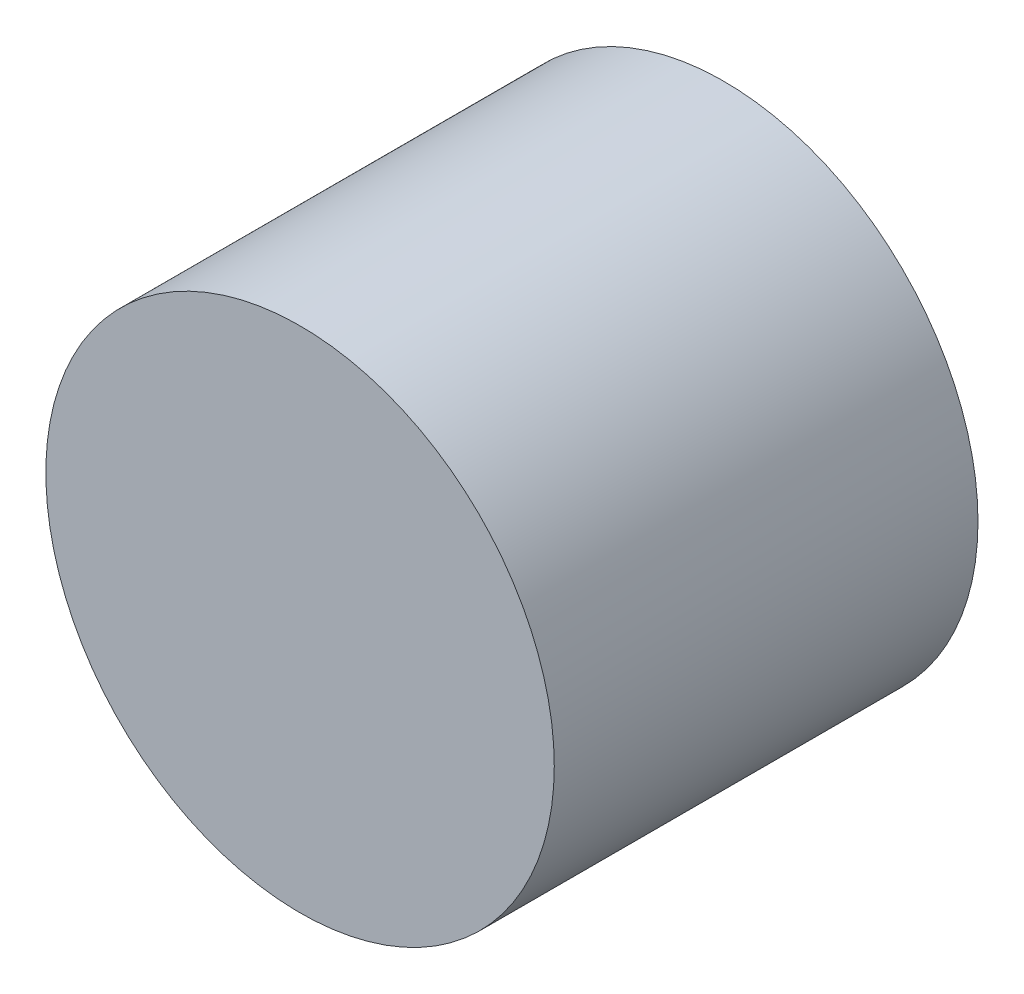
ISO-10303-21;
HEADER;
FILE_DESCRIPTION(('STEP AP214'),'2;1');
FILE_NAME('part.step','',(''),(''),'','','');
FILE_SCHEMA(('AUTOMOTIVE_DESIGN { 1 0 10303 214 1 1 1 1 }'));
ENDSEC;
DATA;
#1=APPLICATION_CONTEXT('core data for automotive mechanical design processes');
#2=APPLICATION_PROTOCOL_DEFINITION('international standard','automotive_design',2000,#1);
#3=PRODUCT_CONTEXT('',#1,'mechanical');
#4=PRODUCT('Part','Part','',(#3));
#5=PRODUCT_RELATED_PRODUCT_CATEGORY('part','',(#4));
#6=PRODUCT_DEFINITION_FORMATION('','',#4);
#7=PRODUCT_DEFINITION_CONTEXT('part definition',#1,'design');
#8=PRODUCT_DEFINITION('design','',#6,#7);
#9=PRODUCT_DEFINITION_SHAPE('','',#8);
#10=(LENGTH_UNIT() NAMED_UNIT(*) SI_UNIT(.MILLI.,.METRE.));
#11=(NAMED_UNIT(*) PLANE_ANGLE_UNIT() SI_UNIT($,.RADIAN.));
#12=(NAMED_UNIT(*) SI_UNIT($,.STERADIAN.) SOLID_ANGLE_UNIT());
#13=UNCERTAINTY_MEASURE_WITH_UNIT(LENGTH_MEASURE(1.E-05),#10,'distance_accuracy_value','');
#14=(GEOMETRIC_REPRESENTATION_CONTEXT(3) GLOBAL_UNCERTAINTY_ASSIGNED_CONTEXT((#13)) GLOBAL_UNIT_ASSIGNED_CONTEXT((#10,
#11,#12)) REPRESENTATION_CONTEXT('',''));
#15=CARTESIAN_POINT('',(0.,0.,0.));
#16=DIRECTION('',(0.,0.,1.));
#17=DIRECTION('',(1.,0.,0.));
#18=AXIS2_PLACEMENT_3D('',#15,#16,#17);
#19=CARTESIAN_POINT('',(0.,0.,9.));
#20=DIRECTION('',(0.,0.,1.));
#21=DIRECTION('',(1.,0.,0.));
#22=AXIS2_PLACEMENT_3D('',#19,#20,#21);
#23=CYLINDRICAL_SURFACE('',#22,3.);
#24=CARTESIAN_POINT('',(0.,0.,0.));
#25=DIRECTION('',(0.,0.,1.));
#26=DIRECTION('',(1.,0.,0.));
#27=AXIS2_PLACEMENT_3D('',#24,#25,#26);
#28=CIRCLE('',#27,3.);
#29=CARTESIAN_POINT('',(3.,0.,0.));
#30=VERTEX_POINT('',#29);
#31=EDGE_CURVE('E69',#30,#30,#28,.T.);
#32=ORIENTED_EDGE('',*,*,#31,.F.);
#33=EDGE_LOOP('',(#32));
#34=FACE_BOUND('',#33,.T.);
#35=CARTESIAN_POINT('',(0.,0.,4.49784845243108));
#36=DIRECTION('',(0.,0.,1.));
#37=DIRECTION('',(1.,0.,0.));
#38=AXIS2_PLACEMENT_3D('',#35,#36,#37);
#39=CIRCLE('',#38,3.);
#40=CARTESIAN_POINT('',(3.,0.,4.49784845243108));
#41=VERTEX_POINT('',#40);
#42=EDGE_CURVE('E11',#41,#41,#39,.T.);
#43=ORIENTED_EDGE('',*,*,#42,.T.);
#44=EDGE_LOOP('',(#43));
#45=FACE_BOUND('',#44,.T.);
#46=ADVANCED_FACE('F34',(#34,#45),#23,.F.);
#47=CARTESIAN_POINT('',(0.,2.5,4.49784845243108));
#48=DIRECTION('',(0.,0.,1.));
#49=DIRECTION('',(1.,0.,0.));
#50=AXIS2_PLACEMENT_3D('',#47,#48,#49);
#51=PLANE('',#50);
#52=ORIENTED_EDGE('',*,*,#42,.F.);
#53=EDGE_LOOP('',(#52));
#54=FACE_BOUND('',#53,.T.);
#55=CARTESIAN_POINT('',(0.,0.,4.49784845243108));
#56=DIRECTION('',(0.,0.,1.));
#57=DIRECTION('',(1.,0.,0.));
#58=AXIS2_PLACEMENT_3D('',#55,#56,#57);
#59=CIRCLE('',#58,2.5);
#60=CARTESIAN_POINT('',(2.5,0.,4.49784845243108));
#61=VERTEX_POINT('',#60);
#62=EDGE_CURVE('E40',#61,#61,#59,.T.);
#63=ORIENTED_EDGE('',*,*,#62,.T.);
#64=EDGE_LOOP('',(#63));
#65=FACE_BOUND('',#64,.T.);
#66=ADVANCED_FACE('F56',(#54,#65),#51,.F.);
#67=CARTESIAN_POINT('',(0.,0.,9.));
#68=DIRECTION('',(0.,0.,1.));
#69=DIRECTION('',(1.,0.,0.));
#70=AXIS2_PLACEMENT_3D('',#67,#68,#69);
#71=CYLINDRICAL_SURFACE('',#70,2.5);
#72=ORIENTED_EDGE('',*,*,#62,.F.);
#73=EDGE_LOOP('',(#72));
#74=FACE_BOUND('',#73,.T.);
#75=CARTESIAN_POINT('',(0.,0.,7.49784845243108));
#76=DIRECTION('',(0.,0.,1.));
#77=DIRECTION('',(1.,0.,0.));
#78=AXIS2_PLACEMENT_3D('',#75,#76,#77);
#79=CIRCLE('',#78,2.5);
#80=CARTESIAN_POINT('',(2.5,0.,7.49784845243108));
#81=VERTEX_POINT('',#80);
#82=EDGE_CURVE('E74',#81,#81,#79,.T.);
#83=ORIENTED_EDGE('',*,*,#82,.T.);
#84=EDGE_LOOP('',(#83));
#85=FACE_BOUND('',#84,.T.);
#86=ADVANCED_FACE('F46',(#74,#85),#71,.F.);
#87=CARTESIAN_POINT('',(0.,0.,9.));
#88=DIRECTION('',(0.,0.,-1.));
#89=DIRECTION('',(-1.,0.,0.));
#90=AXIS2_PLACEMENT_3D('',#87,#88,#89);
#91=CONICAL_SURFACE('',#90,0.,1.02974425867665);
#92=ORIENTED_EDGE('',*,*,#82,.F.);
#93=EDGE_LOOP('',(#92));
#94=FACE_BOUND('',#93,.T.);
#95=CARTESIAN_POINT('',(0.,0.,9.));
#96=VERTEX_POINT('',#95);
#97=VERTEX_LOOP('',#96);
#98=FACE_BOUND('',#97,.T.);
#99=ADVANCED_FACE('F43',(#94,#98),#91,.F.);
#100=CARTESIAN_POINT('',(0.,6.,10.));
#101=DIRECTION('',(0.,0.,-1.));
#102=DIRECTION('',(-1.,0.,0.));
#103=AXIS2_PLACEMENT_3D('',#100,#101,#102);
#104=PLANE('',#103);
#105=CARTESIAN_POINT('',(0.,0.,10.));
#106=DIRECTION('',(0.,0.,1.));
#107=DIRECTION('',(1.,0.,0.));
#108=AXIS2_PLACEMENT_3D('',#105,#106,#107);
#109=CIRCLE('',#108,6.);
#110=CARTESIAN_POINT('',(6.,0.,10.));
#111=VERTEX_POINT('',#110);
#112=EDGE_CURVE('E76',#111,#111,#109,.T.);
#113=ORIENTED_EDGE('',*,*,#112,.T.);
#114=EDGE_LOOP('',(#113));
#115=FACE_BOUND('',#114,.T.);
#116=ADVANCED_FACE('F45',(#115),#104,.F.);
#117=CARTESIAN_POINT('',(0.,0.,9.));
#118=DIRECTION('',(0.,0.,1.));
#119=DIRECTION('',(1.,0.,0.));
#120=AXIS2_PLACEMENT_3D('',#117,#118,#119);
#121=CYLINDRICAL_SURFACE('',#120,6.);
#122=ORIENTED_EDGE('',*,*,#112,.F.);
#123=EDGE_LOOP('',(#122));
#124=FACE_BOUND('',#123,.T.);
#125=CARTESIAN_POINT('',(0.,0.,0.));
#126=DIRECTION('',(0.,0.,1.));
#127=DIRECTION('',(1.,0.,0.));
#128=AXIS2_PLACEMENT_3D('',#125,#126,#127);
#129=CIRCLE('',#128,6.);
#130=CARTESIAN_POINT('',(6.,0.,0.));
#131=VERTEX_POINT('',#130);
#132=EDGE_CURVE('E81',#131,#131,#129,.T.);
#133=ORIENTED_EDGE('',*,*,#132,.T.);
#134=EDGE_LOOP('',(#133));
#135=FACE_BOUND('',#134,.T.);
#136=ADVANCED_FACE('F53',(#124,#135),#121,.T.);
#137=CARTESIAN_POINT('',(0.,6.,0.));
#138=DIRECTION('',(0.,0.,1.));
#139=DIRECTION('',(1.,0.,0.));
#140=AXIS2_PLACEMENT_3D('',#137,#138,#139);
#141=PLANE('',#140);
#142=ORIENTED_EDGE('',*,*,#132,.F.);
#143=EDGE_LOOP('',(#142));
#144=FACE_BOUND('',#143,.T.);
#145=ORIENTED_EDGE('',*,*,#31,.T.);
#146=EDGE_LOOP('',(#145));
#147=FACE_BOUND('',#146,.T.);
#148=ADVANCED_FACE('F85',(#144,#147),#141,.F.);
#149=CLOSED_SHELL('',(#46,#66,#86,#99,#116,#136,#148));
#150=MANIFOLD_SOLID_BREP('B2',#149);
#151=ADVANCED_BREP_SHAPE_REPRESENTATION('',(#18,#150),#14);
#152=SHAPE_DEFINITION_REPRESENTATION(#9,#151);
ENDSEC;
END-ISO-10303-21;
